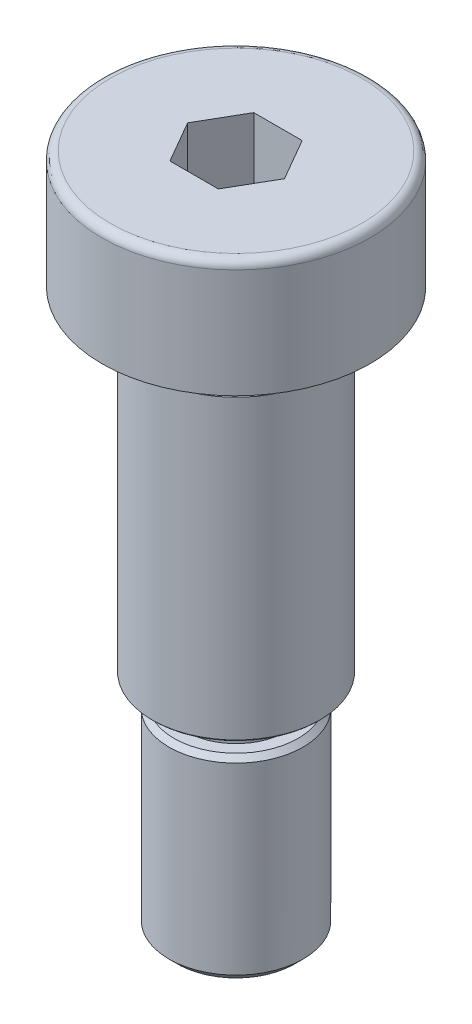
from build123d import *

# Parameters (mm, degrees)
ENL_V_MAT_EXTRU_1_DEPTH = 5
CHANFREIN1_SIZE         = 0.2
CONG_1_R                = 0.1
CHANFREIN2_SIZE         = 0.1
CONG_2_R                = 0.2
CHANFREIN3_SIZE         = 0.5
CHANFREIN4_SIZE         = 0.3


with BuildPart() as part:
    # Esquisse1 → Base-R_volution (revolve)
    with BuildSketch(Plane.XY, mode=Mode.PRIVATE) as base_r_volution_sk:
        with BuildLine():
            Line((0, 40.25), (-7.5, 40.25))
            ThreePointArc((-7.5, 40.25), (-7.853553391, 40.103553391), (-8, 39.75))
            Line((-8, 39.75), (-8, 33.25))
            Line((-8, 33.25), (-4, 33.25))
            Line((-4, 33.25), (-4, 31.25))
            Line((-4, 31.25), (-5, 31.25))
            Line((-5, 31.25), (-5, 13.25))
            Line((-5, 13.25), (-3, 13.25))
            Line((-3, 13.25), (-3, 11.75))
            Line((-3, 11.75), (-4, 11.75))
            Line((-4, 11.75), (-4, 0))
            Line((-4, 0), (0, 0))
            Line((0, 0), (0, 40.25))
        make_face()
    revolve(base_r_volution_sk.sketch.rotate(Axis((0, 50, 0), (0, -1, 0)), 270), axis=Axis((0, 50, 0), (0, -1, 0)))

    # Esquisse2 → Enl_v. mat.-Extru.1 (cut)
    with BuildSketch(Plane(origin=(0, 40.25, 0), x_dir=(-1, 0, 0), z_dir=(0, 1, 0))):
        Polygon((2.886751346, 0), (1.443375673, 2.5), (-1.443375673, 2.5), (-2.886751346, 0), (-1.443375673, -2.5), (1.443375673, -2.5), align=None)
    extrude(amount=-ENL_V_MAT_EXTRU_1_DEPTH, mode=Mode.SUBTRACT)

    # Chanfrein1
    chanfrein1_edges = [part.edges().sort_by_distance(p)[0] for p in [
        (0, 31.25, -5),
    ]]
    chamfer(chanfrein1_edges, length=CHANFREIN1_SIZE)

    # Cong_1
    cong_1_edges = [part.edges().sort_by_distance(p)[0] for p in [
        (0, 33.25, -4),
    ]]
    fillet(cong_1_edges, radius=CONG_1_R)

    # Chanfrein2
    chanfrein2_edges = [part.edges().sort_by_distance(p)[0] for p in [
        (0, 13.25, -5),
    ]]
    chamfer(chanfrein2_edges, length=CHANFREIN2_SIZE)

    # Cong_2
    cong_2_edges = [part.edges().sort_by_distance(p)[0] for p in [
        (0, 13.25, -3),
    ]]
    fillet(cong_2_edges, radius=CONG_2_R)

    # Chanfrein3
    chanfrein3_edges = [part.edges().sort_by_distance(p)[0] for p in [
        (0, 0, -4),
    ]]
    chamfer(chanfrein3_edges, length=CHANFREIN3_SIZE)

    # Chanfrein4
    chanfrein4_edges = [part.edges().sort_by_distance(p)[0] for p in [
        (0, 11.75, -4),
    ]]
    chamfer(chanfrein4_edges, length=CHANFREIN4_SIZE)


solid = part.part
